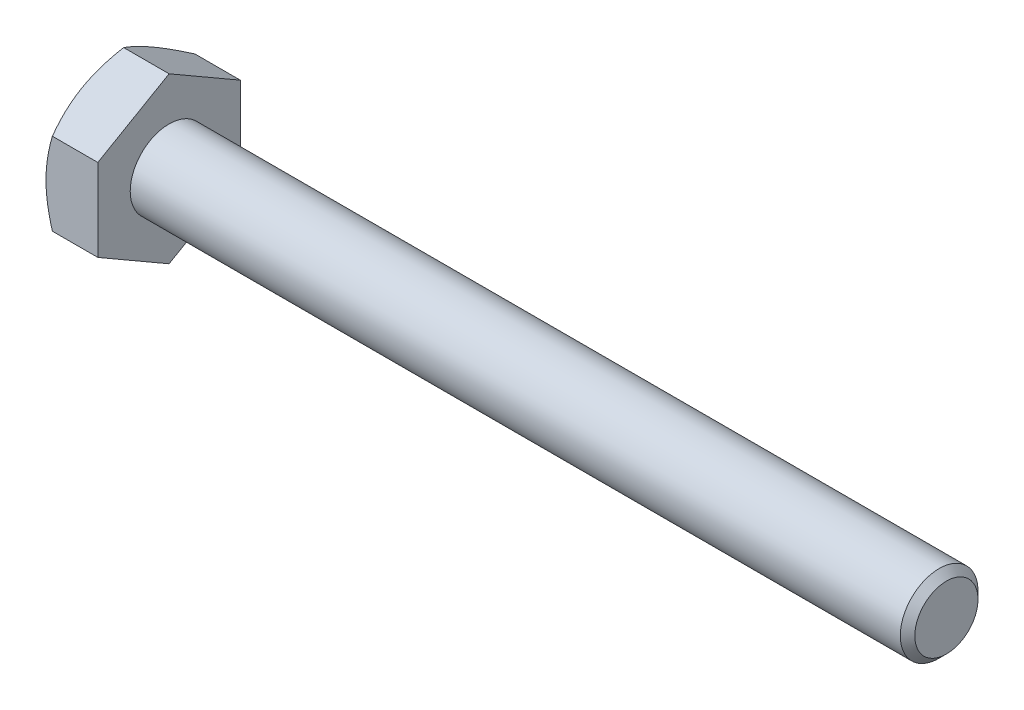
from build123d import *

# Parameters (mm, degrees)
BASEHEAD_DEPTH = 2


with BuildPart() as part:
    # Sketch1 → BaseHead (new body)
    with BuildSketch(Plane(origin=(0, 0, 0), x_dir=(0, 0, -1), z_dir=(1, 0, 0))):
        Polygon((2.75, 1.58771324), (2.75, -1.58771324), (0, -3.175426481), (-2.75, -1.58771324), (-2.75, 1.58771324), (0, 3.175426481), align=None)
    extrude(amount=BASEHEAD_DEPTH)

    # BodySke → BaseBody (revolve)
    with BuildSketch(Plane.XY, mode=Mode.PRIVATE) as basebody_sk:
        Polygon((0, 0), (32, 0), (32, 1.2195), (31.7195, 1.5), (0, 1.5), align=None)
    revolve(basebody_sk.sketch.rotate(Axis((0, 0, 0), (1, 0, 0)), 90), axis=Axis((0, 0, 0), (1, 0, 0)))

    # Sketch3 → HeadChamfer (revolve, cut)
    with BuildSketch(Plane.XY):
        Polygon((0, 2.75), (3.132371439, 8.175426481), (3.132371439, 13.175426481), (-10, 13.175426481), (-10, 2.75), align=None)
    revolve(axis=Axis((0, 0, 0), (1, 0, 0)), mode=Mode.SUBTRACT)


solid = part.part
